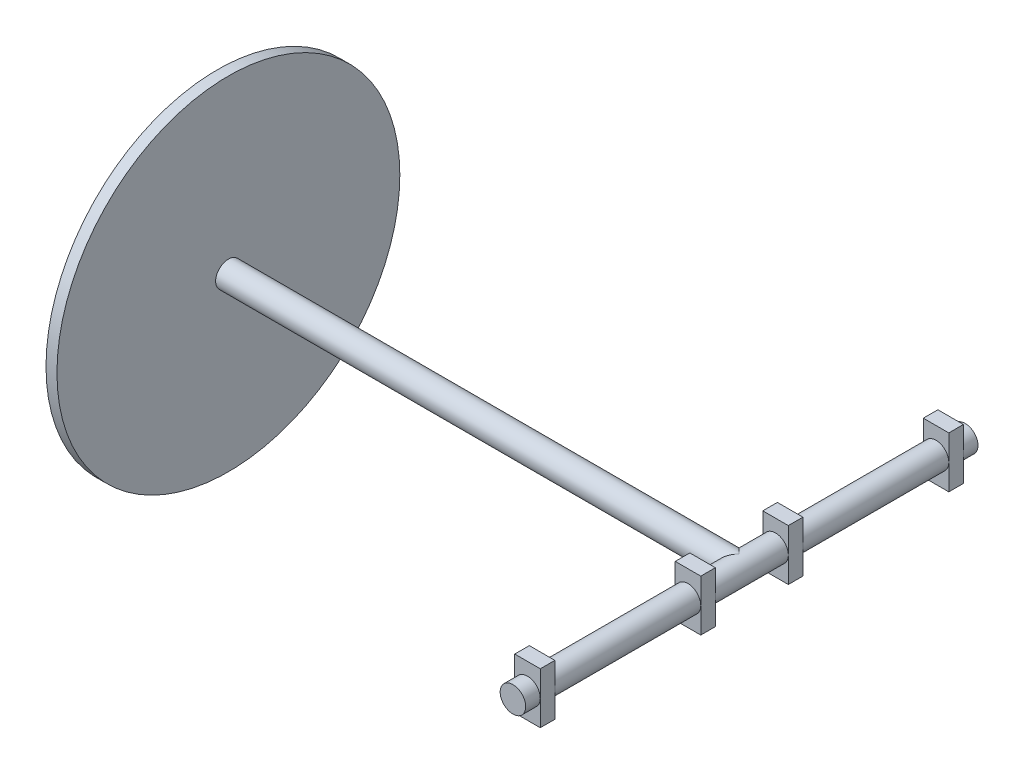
from build123d import *

# Parameters (mm, degrees)
ESQUISSE1_R      = 3.5
EXTRUSION1_DEPTH = 10
ESQUISSE2_W      = 7
ESQUISSE2_H      = 14
EXTRUSION2_DEPTH = 4
EXTRUSION3_DEPTH = 40
EXTRUSION4_DEPTH = 4
EXTRUSION5_DEPTH = 4
ESQUISSE6_R      = 3.5
EXTRUSION6_DEPTH = 140
ESQUISSE7_R      = 47
EXTRUSION7_DEPTH = 3


with BuildPart() as part:
    # Esquisse1 → Extrusion1 (new body)
    with BuildSketch(Plane.XY):
        Circle(ESQUISSE1_R)
    extrusion1 = extrude(amount=EXTRUSION1_DEPTH)

    # Esquisse2 → Extrusion2 (add)
    with BuildSketch(Plane.XY.offset(10)):
        Rectangle(ESQUISSE2_W, ESQUISSE2_H)
    extrusion2 = extrude(amount=EXTRUSION2_DEPTH)

    # Esquisse3 → Extrusion3 (add)
    with BuildSketch(Plane.XY.offset(14)):
        with BuildLine():
            ThreePointArc((-3.5, 0), (0, -3.5), (3.5, 0))
            ThreePointArc((3.5, 0), (0, 3.5), (-3.5, 0))
        make_face()
    extrusion3 = extrude(amount=EXTRUSION3_DEPTH)

    # Esquisse4 → Extrusion4 (add)
    with BuildSketch(Plane.XY.offset(54)):
        Polygon((3.5, 0), (3.5, 7), (-3.5, 7), (-3.5, 0), (-3.5, -7), (3.5, -7), align=None)
    extrusion4 = extrude(amount=EXTRUSION4_DEPTH)

    # Esquisse5 → Extrusion5 (add)
    with BuildSketch(Plane.XY.offset(58)):
        with BuildLine():
            ThreePointArc((-3.5, 0), (0, -3.5), (3.5, 0))
            ThreePointArc((3.5, 0), (0, 3.5), (-3.5, 0))
        make_face()
    extrusion5 = extrude(amount=EXTRUSION5_DEPTH)

    # Sym_trie1: Extrusion1, Extrusion2, Extrusion3, Extrusion4, Extrusion5 across plane
    add(extrusion1.mirror(Plane.XY))
    add(extrusion2.mirror(Plane.XY))
    add(extrusion3.mirror(Plane.XY))
    add(extrusion4.mirror(Plane.XY))
    add(extrusion5.mirror(Plane.XY))

    # Esquisse6 → Extrusion6 (add)
    with BuildSketch(Plane(origin=(0, 0, 0), x_dir=(0, 0, -1), z_dir=(1, 0, 0))):
        Circle(ESQUISSE6_R)
    extrude(amount=-EXTRUSION6_DEPTH)

    # Esquisse7 → Extrusion7 (add)
    with BuildSketch(Plane.ZY.offset(140)):
        Circle(ESQUISSE7_R)
    extrude(amount=EXTRUSION7_DEPTH)


solid = part.part
